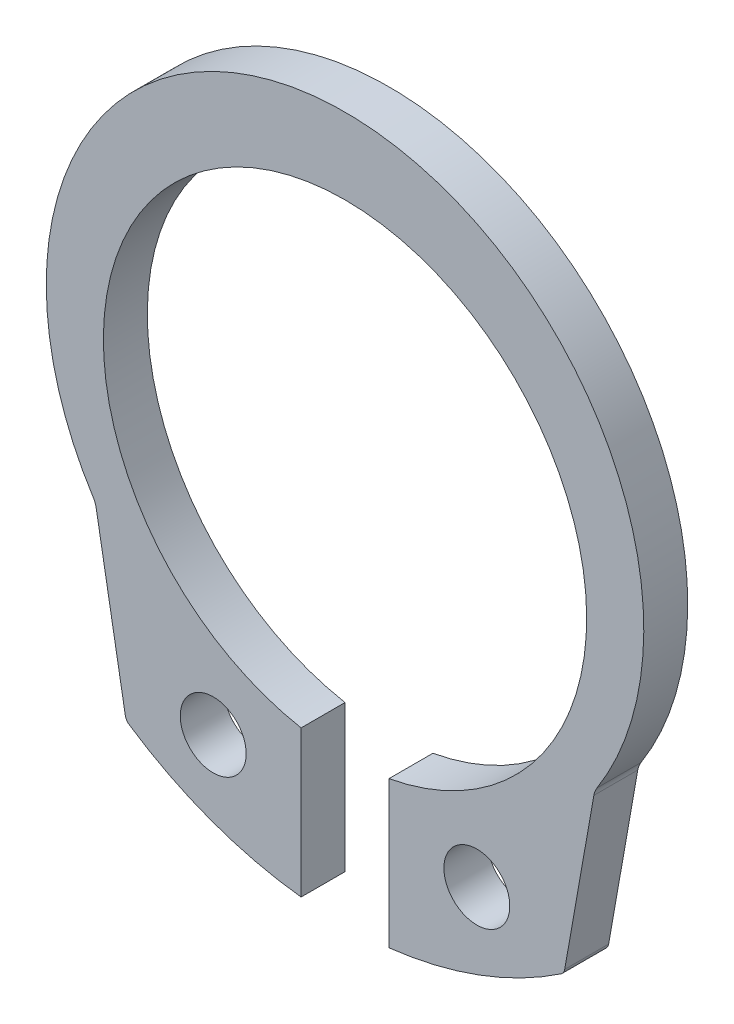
from build123d import *

# Parameters (mm, degrees)
EXTRUDE_979_DEPTH      = 0.5
EXTRUDE_979_DEPTH_BACK = 0.5
SKETCH_1_R             = 0.75


with BuildPart() as part:
    # Sketch 1 → Extrude 979 (new, two sides: drawn at the far end of the back side and taken through both)
    with BuildSketch(Plane.XY.offset(-EXTRUDE_979_DEPTH_BACK)):
        with BuildLine():
            Line((-1, -5.838326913), (-1, -9.172997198))
            ThreePointArc((-1, -9.172997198), (-3.04414488, -8.686705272), (-4.914737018, -7.729682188))
            ThreePointArc((-4.914737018, -7.729682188), (-4.97072657, -7.672778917), (-5, -7.598509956))
            Line((-5, -7.598509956), (-5.663210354, -3.837257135))
            ThreePointArc((-5.663210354, -3.837257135), (-5.689636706, -3.742794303), (-5.733996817, -3.655308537))
            ThreePointArc((-5.733996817, -3.655308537), (0, 6.8), (5.733996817, -3.655308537))
            ThreePointArc((5.733996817, -3.655308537), (5.689636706, -3.742794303), (5.663210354, -3.837257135))
            Line((5.663210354, -3.837257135), (5, -7.598509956))
            ThreePointArc((5, -7.598509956), (4.97072657, -7.672778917), (4.914737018, -7.729682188))
            ThreePointArc((4.914737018, -7.729682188), (3.04414488, -8.686705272), (1, -9.172997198))
            Line((1, -9.172997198), (1, -5.838326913))
            ThreePointArc((1, -5.838326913), (0, 5.07), (-1, -5.838326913))
        make_face()
        with Locations((-3, -6.975227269)):
            Circle(SKETCH_1_R, mode=Mode.SUBTRACT)
        with Locations(Location((3, -6.975227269, 0), (0, 0, 180))):
            Circle(SKETCH_1_R, mode=Mode.SUBTRACT)
    extrude(amount=EXTRUDE_979_DEPTH + EXTRUDE_979_DEPTH_BACK)


solid = part.part
